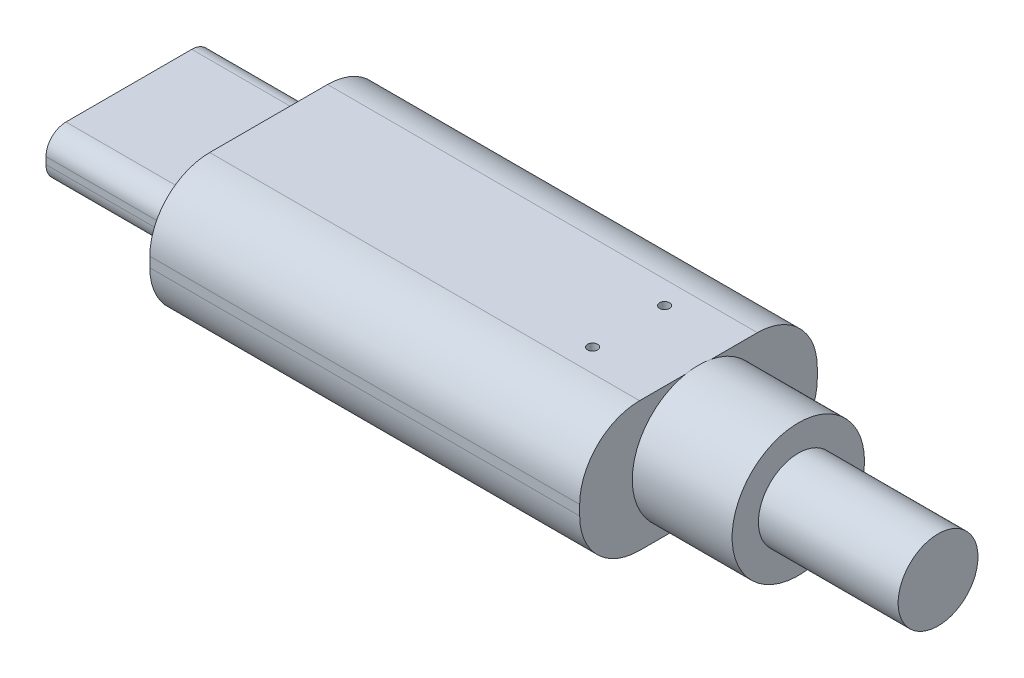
ISO-10303-21;
HEADER;
FILE_DESCRIPTION(('STEP AP214'),'2;1');
FILE_NAME('part.step','',(''),(''),'','','');
FILE_SCHEMA(('AUTOMOTIVE_DESIGN { 1 0 10303 214 1 1 1 1 }'));
ENDSEC;
DATA;
#1=APPLICATION_CONTEXT('core data for automotive mechanical design processes');
#2=APPLICATION_PROTOCOL_DEFINITION('international standard','automotive_design',2000,#1);
#3=PRODUCT_CONTEXT('',#1,'mechanical');
#4=PRODUCT('Part','Part','',(#3));
#5=PRODUCT_RELATED_PRODUCT_CATEGORY('part','',(#4));
#6=PRODUCT_DEFINITION_FORMATION('','',#4);
#7=PRODUCT_DEFINITION_CONTEXT('part definition',#1,'design');
#8=PRODUCT_DEFINITION('design','',#6,#7);
#9=PRODUCT_DEFINITION_SHAPE('','',#8);
#10=(LENGTH_UNIT() NAMED_UNIT(*) SI_UNIT(.MILLI.,.METRE.));
#11=(NAMED_UNIT(*) PLANE_ANGLE_UNIT() SI_UNIT($,.RADIAN.));
#12=(NAMED_UNIT(*) SI_UNIT($,.STERADIAN.) SOLID_ANGLE_UNIT());
#13=UNCERTAINTY_MEASURE_WITH_UNIT(LENGTH_MEASURE(1.E-05),#10,'distance_accuracy_value','');
#14=(GEOMETRIC_REPRESENTATION_CONTEXT(3) GLOBAL_UNCERTAINTY_ASSIGNED_CONTEXT((#13)) GLOBAL_UNIT_ASSIGNED_CONTEXT((#10,
#11,#12)) REPRESENTATION_CONTEXT('',''));
#15=CARTESIAN_POINT('',(0.,0.,0.));
#16=DIRECTION('',(0.,0.,1.));
#17=DIRECTION('',(1.,0.,0.));
#18=AXIS2_PLACEMENT_3D('',#15,#16,#17);
#19=CARTESIAN_POINT('',(-10.765,0.,5.95));
#20=DIRECTION('',(0.,0.,1.));
#21=DIRECTION('',(1.,0.,0.));
#22=AXIS2_PLACEMENT_3D('',#19,#20,#21);
#23=PLANE('',#22);
#24=DIRECTION('',(-1.,0.,0.));
#25=VECTOR('',#24,1.);
#26=CARTESIAN_POINT('',(-5.3825,3.,5.95));
#27=LINE('',#26,#25);
#28=CARTESIAN_POINT('',(10.765,3.,5.95));
#29=VERTEX_POINT('',#28);
#30=CARTESIAN_POINT('',(-10.765,3.,5.95));
#31=VERTEX_POINT('',#30);
#32=EDGE_CURVE('E207',#29,#31,#27,.T.);
#33=ORIENTED_EDGE('',*,*,#32,.F.);
#34=DIRECTION('',(0.,1.,0.));
#35=VECTOR('',#34,1.);
#36=CARTESIAN_POINT('',(10.765,0.,5.95));
#37=LINE('',#36,#35);
#38=CARTESIAN_POINT('',(10.765,3.5,5.95));
#39=VERTEX_POINT('',#38);
#40=EDGE_CURVE('E11',#29,#39,#37,.T.);
#41=ORIENTED_EDGE('',*,*,#40,.T.);
#42=DIRECTION('',(1.,0.,0.));
#43=VECTOR('',#42,1.);
#44=CARTESIAN_POINT('',(-5.3825,3.5,5.95));
#45=LINE('',#44,#43);
#46=CARTESIAN_POINT('',(-10.765,3.5,5.95));
#47=VERTEX_POINT('',#46);
#48=EDGE_CURVE('E466',#47,#39,#45,.T.);
#49=ORIENTED_EDGE('',*,*,#48,.F.);
#50=DIRECTION('',(0.,1.,0.));
#51=VECTOR('',#50,1.);
#52=CARTESIAN_POINT('',(-10.765,0.,5.95));
#53=LINE('',#52,#51);
#54=EDGE_CURVE('E218',#31,#47,#53,.T.);
#55=ORIENTED_EDGE('',*,*,#54,.F.);
#56=EDGE_LOOP('',(#33,#41,#49,#55));
#57=FACE_BOUND('',#56,.T.);
#58=ADVANCED_FACE('F17',(#57),#23,.T.);
#59=CARTESIAN_POINT('',(10.765,0.,-5.95));
#60=DIRECTION('',(0.,0.,-1.));
#61=DIRECTION('',(0.,-1.,0.));
#62=AXIS2_PLACEMENT_3D('',#59,#60,#61);
#63=PLANE('',#62);
#64=DIRECTION('',(1.,0.,0.));
#65=VECTOR('',#64,1.);
#66=CARTESIAN_POINT('',(5.3825,3.,-5.95));
#67=LINE('',#66,#65);
#68=CARTESIAN_POINT('',(-10.765,3.,-5.95));
#69=VERTEX_POINT('',#68);
#70=CARTESIAN_POINT('',(10.765,3.,-5.95));
#71=VERTEX_POINT('',#70);
#72=EDGE_CURVE('E224',#69,#71,#67,.T.);
#73=ORIENTED_EDGE('',*,*,#72,.F.);
#74=DIRECTION('',(0.,1.,0.));
#75=VECTOR('',#74,1.);
#76=CARTESIAN_POINT('',(-10.765,0.,-5.95));
#77=LINE('',#76,#75);
#78=CARTESIAN_POINT('',(-10.765,3.5,-5.95));
#79=VERTEX_POINT('',#78);
#80=EDGE_CURVE('E212',#69,#79,#77,.T.);
#81=ORIENTED_EDGE('',*,*,#80,.T.);
#82=DIRECTION('',(-1.,0.,0.));
#83=VECTOR('',#82,1.);
#84=CARTESIAN_POINT('',(5.3825,3.5,-5.95));
#85=LINE('',#84,#83);
#86=CARTESIAN_POINT('',(10.765,3.5,-5.95));
#87=VERTEX_POINT('',#86);
#88=EDGE_CURVE('E326',#87,#79,#85,.T.);
#89=ORIENTED_EDGE('',*,*,#88,.F.);
#90=DIRECTION('',(0.,1.,0.));
#91=VECTOR('',#90,1.);
#92=CARTESIAN_POINT('',(10.765,0.,-5.95));
#93=LINE('',#92,#91);
#94=EDGE_CURVE('E219',#71,#87,#93,.T.);
#95=ORIENTED_EDGE('',*,*,#94,.F.);
#96=EDGE_LOOP('',(#73,#81,#89,#95));
#97=FACE_BOUND('',#96,.T.);
#98=ADVANCED_FACE('F382',(#97),#63,.T.);
#99=CARTESIAN_POINT('',(10.765,0.,5.95));
#100=DIRECTION('',(1.,0.,0.));
#101=DIRECTION('',(0.,0.,-1.));
#102=AXIS2_PLACEMENT_3D('',#99,#100,#101);
#103=PLANE('',#102);
#104=CARTESIAN_POINT('',(10.765,3.,2.95));
#105=DIRECTION('',(-1.,0.,0.));
#106=DIRECTION('',(0.,-0.707106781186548,0.707106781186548));
#107=AXIS2_PLACEMENT_3D('',#104,#105,#106);
#108=CIRCLE('',#107,3.);
#109=CARTESIAN_POINT('',(10.765,0.,2.95));
#110=VERTEX_POINT('',#109);
#111=EDGE_CURVE('E203',#110,#29,#108,.T.);
#112=ORIENTED_EDGE('',*,*,#111,.F.);
#113=DIRECTION('',(0.,0.,1.));
#114=VECTOR('',#113,1.);
#115=CARTESIAN_POINT('',(10.765,0.,-5.95));
#116=LINE('',#115,#114);
#117=CARTESIAN_POINT('',(10.765,0.,0.653241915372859));
#118=VERTEX_POINT('',#117);
#119=EDGE_CURVE('E317',#118,#110,#116,.T.);
#120=ORIENTED_EDGE('',*,*,#119,.F.);
#121=CARTESIAN_POINT('',(10.765,3.25,0.));
#122=DIRECTION('',(-1.,0.,0.));
#123=DIRECTION('',(0.,0.,1.));
#124=AXIS2_PLACEMENT_3D('',#121,#122,#123);
#125=CIRCLE('',#124,3.315);
#126=CARTESIAN_POINT('',(10.765,6.5,0.653241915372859));
#127=VERTEX_POINT('',#126);
#128=EDGE_CURVE('E28',#118,#127,#125,.T.);
#129=ORIENTED_EDGE('',*,*,#128,.T.);
#130=DIRECTION('',(0.,0.,-1.));
#131=VECTOR('',#130,1.);
#132=CARTESIAN_POINT('',(10.765,6.5,-5.95));
#133=LINE('',#132,#131);
#134=CARTESIAN_POINT('',(10.765,6.5,2.95));
#135=VERTEX_POINT('',#134);
#136=EDGE_CURVE('E416',#135,#127,#133,.T.);
#137=ORIENTED_EDGE('',*,*,#136,.F.);
#138=CARTESIAN_POINT('',(10.765,3.5,2.95));
#139=DIRECTION('',(-1.,0.,0.));
#140=DIRECTION('',(0.,0.707106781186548,0.707106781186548));
#141=AXIS2_PLACEMENT_3D('',#138,#139,#140);
#142=CIRCLE('',#141,3.);
#143=EDGE_CURVE('E418',#39,#135,#142,.T.);
#144=ORIENTED_EDGE('',*,*,#143,.F.);
#145=ORIENTED_EDGE('',*,*,#40,.F.);
#146=EDGE_LOOP('',(#112,#120,#129,#137,#144,#145));
#147=FACE_BOUND('',#146,.T.);
#148=ADVANCED_FACE('F463',(#147),#103,.T.);
#149=CARTESIAN_POINT('',(15.765,3.25,0.));
#150=DIRECTION('',(1.,0.,0.));
#151=DIRECTION('',(0.,0.,-1.));
#152=AXIS2_PLACEMENT_3D('',#149,#150,#151);
#153=PLANE('',#152);
#154=CARTESIAN_POINT('',(15.765,3.25,0.));
#155=DIRECTION('',(-1.,0.,0.));
#156=DIRECTION('',(0.,0.,1.));
#157=AXIS2_PLACEMENT_3D('',#154,#155,#156);
#158=CIRCLE('',#157,2.);
#159=CARTESIAN_POINT('',(15.765,3.25,-2.));
#160=VERTEX_POINT('',#159);
#161=EDGE_CURVE('E338',#160,#160,#158,.T.);
#162=ORIENTED_EDGE('',*,*,#161,.T.);
#163=EDGE_LOOP('',(#162));
#164=FACE_BOUND('',#163,.T.);
#165=CARTESIAN_POINT('',(15.765,3.25,0.));
#166=DIRECTION('',(1.,0.,0.));
#167=DIRECTION('',(0.,0.,1.));
#168=AXIS2_PLACEMENT_3D('',#165,#166,#167);
#169=CIRCLE('',#168,3.315);
#170=CARTESIAN_POINT('',(15.765,3.25,-3.315));
#171=VERTEX_POINT('',#170);
#172=EDGE_CURVE('E277',#171,#171,#169,.T.);
#173=ORIENTED_EDGE('',*,*,#172,.T.);
#174=EDGE_LOOP('',(#173));
#175=FACE_BOUND('',#174,.T.);
#176=ADVANCED_FACE('F549',(#164,#175),#153,.T.);
#177=CARTESIAN_POINT('',(10.765,3.25,0.));
#178=DIRECTION('',(1.,0.,0.));
#179=DIRECTION('',(0.,0.,1.));
#180=AXIS2_PLACEMENT_3D('',#177,#178,#179);
#181=CYLINDRICAL_SURFACE('',#180,3.315);
#182=ORIENTED_EDGE('',*,*,#172,.F.);
#183=DIRECTION('',(-1.,0.,0.));
#184=VECTOR('',#183,1.);
#185=CARTESIAN_POINT('',(10.765,3.25,-3.315));
#186=LINE('',#185,#184);
#187=CARTESIAN_POINT('',(10.765,3.25,-3.315));
#188=VERTEX_POINT('',#187);
#189=EDGE_CURVE('E42',#171,#188,#186,.T.);
#190=ORIENTED_EDGE('',*,*,#189,.T.);
#191=CARTESIAN_POINT('',(10.765,3.25,0.));
#192=DIRECTION('',(-1.,0.,0.));
#193=DIRECTION('',(0.,0.,1.));
#194=AXIS2_PLACEMENT_3D('',#191,#192,#193);
#195=CIRCLE('',#194,3.315);
#196=CARTESIAN_POINT('',(10.765,6.5,-0.653241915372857));
#197=VERTEX_POINT('',#196);
#198=EDGE_CURVE('E321',#197,#188,#195,.T.);
#199=ORIENTED_EDGE('',*,*,#198,.F.);
#200=CARTESIAN_POINT('',(10.765,3.25,0.));
#201=DIRECTION('',(-1.,0.,0.));
#202=DIRECTION('',(0.,0.,1.));
#203=AXIS2_PLACEMENT_3D('',#200,#201,#202);
#204=CIRCLE('',#203,3.315);
#205=EDGE_CURVE('E278',#127,#197,#204,.T.);
#206=ORIENTED_EDGE('',*,*,#205,.F.);
#207=ORIENTED_EDGE('',*,*,#128,.F.);
#208=CARTESIAN_POINT('',(10.765,3.25,0.));
#209=DIRECTION('',(-1.,0.,0.));
#210=DIRECTION('',(0.,0.,1.));
#211=AXIS2_PLACEMENT_3D('',#208,#209,#210);
#212=CIRCLE('',#211,3.315);
#213=CARTESIAN_POINT('',(10.765,0.,-0.653241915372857));
#214=VERTEX_POINT('',#213);
#215=EDGE_CURVE('E273',#214,#118,#212,.T.);
#216=ORIENTED_EDGE('',*,*,#215,.F.);
#217=CARTESIAN_POINT('',(10.765,3.25,0.));
#218=DIRECTION('',(-1.,0.,0.));
#219=DIRECTION('',(0.,0.,1.));
#220=AXIS2_PLACEMENT_3D('',#217,#218,#219);
#221=CIRCLE('',#220,3.315);
#222=EDGE_CURVE('E325',#188,#214,#221,.T.);
#223=ORIENTED_EDGE('',*,*,#222,.F.);
#224=ORIENTED_EDGE('',*,*,#189,.F.);
#225=EDGE_LOOP('',(#182,#190,#199,#206,#207,#216,#223,#224));
#226=FACE_BOUND('',#225,.T.);
#227=ADVANCED_FACE('F408',(#226),#181,.T.);
#228=CARTESIAN_POINT('',(10.765,3.25,0.));
#229=DIRECTION('',(1.,0.,0.));
#230=DIRECTION('',(0.,0.,-1.));
#231=AXIS2_PLACEMENT_3D('',#228,#229,#230);
#232=PLANE('',#231);
#233=DIRECTION('',(0.,0.,1.));
#234=VECTOR('',#233,1.);
#235=CARTESIAN_POINT('',(10.765,0.,-5.95));
#236=LINE('',#235,#234);
#237=EDGE_CURVE('E250',#214,#118,#236,.T.);
#238=ORIENTED_EDGE('',*,*,#237,.F.);
#239=ORIENTED_EDGE('',*,*,#215,.T.);
#240=EDGE_LOOP('',(#238,#239));
#241=FACE_BOUND('',#240,.T.);
#242=ADVANCED_FACE('F548',(#241),#232,.F.);
#243=CARTESIAN_POINT('',(10.765,3.25,0.));
#244=DIRECTION('',(1.,0.,0.));
#245=DIRECTION('',(0.,0.,-1.));
#246=AXIS2_PLACEMENT_3D('',#243,#244,#245);
#247=PLANE('',#246);
#248=DIRECTION('',(0.,0.,-1.));
#249=VECTOR('',#248,1.);
#250=CARTESIAN_POINT('',(10.765,6.5,-5.95));
#251=LINE('',#250,#249);
#252=EDGE_CURVE('E245',#127,#197,#251,.T.);
#253=ORIENTED_EDGE('',*,*,#252,.F.);
#254=ORIENTED_EDGE('',*,*,#205,.T.);
#255=EDGE_LOOP('',(#253,#254));
#256=FACE_BOUND('',#255,.T.);
#257=ADVANCED_FACE('F553',(#256),#247,.F.);
#258=CARTESIAN_POINT('',(-10.765,2.075,4.15));
#259=DIRECTION('',(0.,0.,1.));
#260=DIRECTION('',(1.,0.,0.));
#261=AXIS2_PLACEMENT_3D('',#258,#259,#260);
#262=PLANE('',#261);
#263=DIRECTION('',(-1.,0.,0.));
#264=VECTOR('',#263,1.);
#265=CARTESIAN_POINT('',(-10.765,3.075,4.15));
#266=LINE('',#265,#264);
#267=CARTESIAN_POINT('',(-10.765,3.075,4.15));
#268=VERTEX_POINT('',#267);
#269=CARTESIAN_POINT('',(-17.765,3.075,4.15));
#270=VERTEX_POINT('',#269);
#271=EDGE_CURVE('E197',#268,#270,#266,.T.);
#272=ORIENTED_EDGE('',*,*,#271,.F.);
#273=DIRECTION('',(0.,-1.,0.));
#274=VECTOR('',#273,1.);
#275=CARTESIAN_POINT('',(-10.765,1.0375,4.15));
#276=LINE('',#275,#274);
#277=CARTESIAN_POINT('',(-10.765,3.425,4.15));
#278=VERTEX_POINT('',#277);
#279=EDGE_CURVE('E264',#278,#268,#276,.T.);
#280=ORIENTED_EDGE('',*,*,#279,.F.);
#281=DIRECTION('',(1.,0.,0.));
#282=VECTOR('',#281,1.);
#283=CARTESIAN_POINT('',(-10.765,3.425,4.15));
#284=LINE('',#283,#282);
#285=CARTESIAN_POINT('',(-17.765,3.425,4.15));
#286=VERTEX_POINT('',#285);
#287=EDGE_CURVE('E201',#286,#278,#284,.T.);
#288=ORIENTED_EDGE('',*,*,#287,.F.);
#289=DIRECTION('',(0.,1.,0.));
#290=VECTOR('',#289,1.);
#291=CARTESIAN_POINT('',(-17.765,2.075,4.15));
#292=LINE('',#291,#290);
#293=EDGE_CURVE('E344',#270,#286,#292,.T.);
#294=ORIENTED_EDGE('',*,*,#293,.F.);
#295=EDGE_LOOP('',(#272,#280,#288,#294));
#296=FACE_BOUND('',#295,.T.);
#297=ADVANCED_FACE('F556',(#296),#262,.T.);
#298=CARTESIAN_POINT('',(-10.765,4.425,-4.15));
#299=DIRECTION('',(0.,0.,-1.));
#300=DIRECTION('',(0.,-1.,0.));
#301=AXIS2_PLACEMENT_3D('',#298,#299,#300);
#302=PLANE('',#301);
#303=DIRECTION('',(-1.,0.,0.));
#304=VECTOR('',#303,1.);
#305=CARTESIAN_POINT('',(-10.765,3.425,-4.15));
#306=LINE('',#305,#304);
#307=CARTESIAN_POINT('',(-10.765,3.425,-4.15));
#308=VERTEX_POINT('',#307);
#309=CARTESIAN_POINT('',(-17.765,3.425,-4.15));
#310=VERTEX_POINT('',#309);
#311=EDGE_CURVE('E282',#308,#310,#306,.T.);
#312=ORIENTED_EDGE('',*,*,#311,.F.);
#313=DIRECTION('',(0.,1.,0.));
#314=VECTOR('',#313,1.);
#315=CARTESIAN_POINT('',(-10.765,2.2125,-4.15));
#316=LINE('',#315,#314);
#317=CARTESIAN_POINT('',(-10.765,3.075,-4.15));
#318=VERTEX_POINT('',#317);
#319=EDGE_CURVE('E233',#318,#308,#316,.T.);
#320=ORIENTED_EDGE('',*,*,#319,.F.);
#321=DIRECTION('',(1.,0.,0.));
#322=VECTOR('',#321,1.);
#323=CARTESIAN_POINT('',(-10.765,3.075,-4.15));
#324=LINE('',#323,#322);
#325=CARTESIAN_POINT('',(-17.765,3.075,-4.15));
#326=VERTEX_POINT('',#325);
#327=EDGE_CURVE('E256',#326,#318,#324,.T.);
#328=ORIENTED_EDGE('',*,*,#327,.F.);
#329=DIRECTION('',(0.,-1.,0.));
#330=VECTOR('',#329,1.);
#331=CARTESIAN_POINT('',(-17.765,4.425,-4.15));
#332=LINE('',#331,#330);
#333=EDGE_CURVE('E292',#310,#326,#332,.T.);
#334=ORIENTED_EDGE('',*,*,#333,.F.);
#335=EDGE_LOOP('',(#312,#320,#328,#334));
#336=FACE_BOUND('',#335,.T.);
#337=ADVANCED_FACE('F558',(#336),#302,.T.);
#338=CARTESIAN_POINT('',(5.3825,3.5,-2.95));
#339=DIRECTION('',(-1.,0.,0.));
#340=DIRECTION('',(0.,0.707106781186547,-0.707106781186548));
#341=AXIS2_PLACEMENT_3D('',#338,#339,#340);
#342=CYLINDRICAL_SURFACE('',#341,3.);
#343=CARTESIAN_POINT('',(-10.765,3.5,-2.95));
#344=DIRECTION('',(1.,0.,0.));
#345=DIRECTION('',(0.,0.707106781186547,-0.707106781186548));
#346=AXIS2_PLACEMENT_3D('',#343,#344,#345);
#347=CIRCLE('',#346,3.);
#348=CARTESIAN_POINT('',(-10.765,6.5,-2.95));
#349=VERTEX_POINT('',#348);
#350=EDGE_CURVE('E208',#79,#349,#347,.T.);
#351=ORIENTED_EDGE('',*,*,#350,.T.);
#352=DIRECTION('',(1.,0.,0.));
#353=VECTOR('',#352,1.);
#354=CARTESIAN_POINT('',(5.3825,6.5,-2.95));
#355=LINE('',#354,#353);
#356=CARTESIAN_POINT('',(10.765,6.5,-2.95));
#357=VERTEX_POINT('',#356);
#358=EDGE_CURVE('E244',#349,#357,#355,.T.);
#359=ORIENTED_EDGE('',*,*,#358,.T.);
#360=CARTESIAN_POINT('',(10.765,3.5,-2.95));
#361=DIRECTION('',(-1.,0.,0.));
#362=DIRECTION('',(0.,0.707106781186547,-0.707106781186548));
#363=AXIS2_PLACEMENT_3D('',#360,#361,#362);
#364=CIRCLE('',#363,3.);
#365=EDGE_CURVE('E223',#357,#87,#364,.T.);
#366=ORIENTED_EDGE('',*,*,#365,.T.);
#367=ORIENTED_EDGE('',*,*,#88,.T.);
#368=EDGE_LOOP('',(#351,#359,#366,#367));
#369=FACE_BOUND('',#368,.T.);
#370=ADVANCED_FACE('F374',(#369),#342,.T.);
#371=CARTESIAN_POINT('',(10.765,0.,5.95));
#372=DIRECTION('',(1.,0.,0.));
#373=DIRECTION('',(0.,0.,-1.));
#374=AXIS2_PLACEMENT_3D('',#371,#372,#373);
#375=PLANE('',#374);
#376=CARTESIAN_POINT('',(10.765,3.,-2.95));
#377=DIRECTION('',(-1.,0.,0.));
#378=DIRECTION('',(0.,-0.707106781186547,-0.707106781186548));
#379=AXIS2_PLACEMENT_3D('',#376,#377,#378);
#380=CIRCLE('',#379,3.);
#381=CARTESIAN_POINT('',(10.765,0.,-2.95));
#382=VERTEX_POINT('',#381);
#383=EDGE_CURVE('E228',#71,#382,#380,.T.);
#384=ORIENTED_EDGE('',*,*,#383,.F.);
#385=ORIENTED_EDGE('',*,*,#94,.T.);
#386=ORIENTED_EDGE('',*,*,#365,.F.);
#387=DIRECTION('',(0.,0.,-1.));
#388=VECTOR('',#387,1.);
#389=CARTESIAN_POINT('',(10.765,6.5,-5.95));
#390=LINE('',#389,#388);
#391=EDGE_CURVE('E240',#197,#357,#390,.T.);
#392=ORIENTED_EDGE('',*,*,#391,.F.);
#393=ORIENTED_EDGE('',*,*,#198,.T.);
#394=ORIENTED_EDGE('',*,*,#222,.T.);
#395=DIRECTION('',(0.,0.,1.));
#396=VECTOR('',#395,1.);
#397=CARTESIAN_POINT('',(10.765,0.,-5.95));
#398=LINE('',#397,#396);
#399=EDGE_CURVE('E246',#382,#214,#398,.T.);
#400=ORIENTED_EDGE('',*,*,#399,.F.);
#401=EDGE_LOOP('',(#384,#385,#386,#392,#393,#394,#400));
#402=FACE_BOUND('',#401,.T.);
#403=ADVANCED_FACE('F378',(#402),#375,.T.);
#404=CARTESIAN_POINT('',(5.3825,3.,-2.95));
#405=DIRECTION('',(1.,0.,0.));
#406=DIRECTION('',(0.,-0.707106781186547,-0.707106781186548));
#407=AXIS2_PLACEMENT_3D('',#404,#405,#406);
#408=CYLINDRICAL_SURFACE('',#407,3.);
#409=ORIENTED_EDGE('',*,*,#383,.T.);
#410=DIRECTION('',(-1.,0.,0.));
#411=VECTOR('',#410,1.);
#412=CARTESIAN_POINT('',(5.3825,0.,-2.95));
#413=LINE('',#412,#411);
#414=CARTESIAN_POINT('',(-10.765,0.,-2.95));
#415=VERTEX_POINT('',#414);
#416=EDGE_CURVE('E251',#382,#415,#413,.T.);
#417=ORIENTED_EDGE('',*,*,#416,.T.);
#418=CARTESIAN_POINT('',(-10.765,3.,-2.95));
#419=DIRECTION('',(1.,0.,0.));
#420=DIRECTION('',(0.,-0.707106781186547,-0.707106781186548));
#421=AXIS2_PLACEMENT_3D('',#418,#419,#420);
#422=CIRCLE('',#421,3.);
#423=EDGE_CURVE('E229',#415,#69,#422,.T.);
#424=ORIENTED_EDGE('',*,*,#423,.T.);
#425=ORIENTED_EDGE('',*,*,#72,.T.);
#426=EDGE_LOOP('',(#409,#417,#424,#425));
#427=FACE_BOUND('',#426,.T.);
#428=ADVANCED_FACE('F384',(#427),#408,.T.);
#429=CARTESIAN_POINT('',(0.,6.5,0.));
#430=DIRECTION('',(0.,1.,0.));
#431=DIRECTION('',(1.,0.,0.));
#432=AXIS2_PLACEMENT_3D('',#429,#430,#431);
#433=PLANE('',#432);
#434=CARTESIAN_POINT('',(7.265,6.5,-1.80162095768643));
#435=DIRECTION('',(0.,-1.,0.));
#436=DIRECTION('',(-1.,0.,0.));
#437=AXIS2_PLACEMENT_3D('',#434,#435,#436);
#438=CIRCLE('',#437,0.25);
#439=CARTESIAN_POINT('',(7.515,6.5,-1.80162095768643));
#440=VERTEX_POINT('',#439);
#441=EDGE_CURVE('E191',#440,#440,#438,.T.);
#442=ORIENTED_EDGE('',*,*,#441,.T.);
#443=EDGE_LOOP('',(#442));
#444=FACE_BOUND('',#443,.T.);
#445=CARTESIAN_POINT('',(7.265,6.5,1.80162095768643));
#446=DIRECTION('',(0.,-1.,0.));
#447=DIRECTION('',(-1.,0.,0.));
#448=AXIS2_PLACEMENT_3D('',#445,#446,#447);
#449=CIRCLE('',#448,0.25);
#450=CARTESIAN_POINT('',(7.515,6.5,1.80162095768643));
#451=VERTEX_POINT('',#450);
#452=EDGE_CURVE('E239',#451,#451,#449,.T.);
#453=ORIENTED_EDGE('',*,*,#452,.T.);
#454=EDGE_LOOP('',(#453));
#455=FACE_BOUND('',#454,.T.);
#456=DIRECTION('',(-1.,0.,0.));
#457=VECTOR('',#456,1.);
#458=CARTESIAN_POINT('',(-5.3825,6.5,2.95));
#459=LINE('',#458,#457);
#460=CARTESIAN_POINT('',(-10.765,6.5,2.95));
#461=VERTEX_POINT('',#460);
#462=EDGE_CURVE('E21',#135,#461,#459,.T.);
#463=ORIENTED_EDGE('',*,*,#462,.F.);
#464=ORIENTED_EDGE('',*,*,#136,.T.);
#465=ORIENTED_EDGE('',*,*,#252,.T.);
#466=ORIENTED_EDGE('',*,*,#391,.T.);
#467=ORIENTED_EDGE('',*,*,#358,.F.);
#468=DIRECTION('',(0.,0.,1.));
#469=VECTOR('',#468,1.);
#470=CARTESIAN_POINT('',(-10.765,6.5,5.95));
#471=LINE('',#470,#469);
#472=EDGE_CURVE('E213',#349,#461,#471,.T.);
#473=ORIENTED_EDGE('',*,*,#472,.T.);
#474=EDGE_LOOP('',(#463,#464,#465,#466,#467,#473));
#475=FACE_BOUND('',#474,.T.);
#476=ADVANCED_FACE('F399',(#444,#455,#475),#433,.T.);
#477=CARTESIAN_POINT('',(-5.3825,3.5,2.95));
#478=DIRECTION('',(1.,0.,0.));
#479=DIRECTION('',(0.,0.707106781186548,0.707106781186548));
#480=AXIS2_PLACEMENT_3D('',#477,#478,#479);
#481=CYLINDRICAL_SURFACE('',#480,3.);
#482=ORIENTED_EDGE('',*,*,#143,.T.);
#483=ORIENTED_EDGE('',*,*,#462,.T.);
#484=CARTESIAN_POINT('',(-10.765,3.5,2.95));
#485=DIRECTION('',(1.,0.,0.));
#486=DIRECTION('',(0.,0.707106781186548,0.707106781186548));
#487=AXIS2_PLACEMENT_3D('',#484,#485,#486);
#488=CIRCLE('',#487,3.);
#489=EDGE_CURVE('E214',#461,#47,#488,.T.);
#490=ORIENTED_EDGE('',*,*,#489,.T.);
#491=ORIENTED_EDGE('',*,*,#48,.T.);
#492=EDGE_LOOP('',(#482,#483,#490,#491));
#493=FACE_BOUND('',#492,.T.);
#494=ADVANCED_FACE('F511',(#493),#481,.T.);
#495=CARTESIAN_POINT('',(-10.765,0.,-5.95));
#496=DIRECTION('',(-1.,0.,0.));
#497=DIRECTION('',(0.,0.,1.));
#498=AXIS2_PLACEMENT_3D('',#495,#496,#497);
#499=PLANE('',#498);
#500=ORIENTED_EDGE('',*,*,#319,.T.);
#501=CARTESIAN_POINT('',(-10.765,3.425,-3.15));
#502=DIRECTION('',(-1.,0.,0.));
#503=DIRECTION('',(0.,0.707106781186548,-0.707106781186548));
#504=AXIS2_PLACEMENT_3D('',#501,#502,#503);
#505=CIRCLE('',#504,1.);
#506=CARTESIAN_POINT('',(-10.765,4.425,-3.15));
#507=VERTEX_POINT('',#506);
#508=EDGE_CURVE('E271',#507,#308,#505,.T.);
#509=ORIENTED_EDGE('',*,*,#508,.F.);
#510=DIRECTION('',(0.,0.,1.));
#511=VECTOR('',#510,1.);
#512=CARTESIAN_POINT('',(-10.765,4.425,-0.9));
#513=LINE('',#512,#511);
#514=CARTESIAN_POINT('',(-10.765,4.425,3.15));
#515=VERTEX_POINT('',#514);
#516=EDGE_CURVE('E363',#507,#515,#513,.T.);
#517=ORIENTED_EDGE('',*,*,#516,.T.);
#518=CARTESIAN_POINT('',(-10.765,3.425,3.15));
#519=DIRECTION('',(-1.,0.,0.));
#520=DIRECTION('',(0.,0.707106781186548,0.707106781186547));
#521=AXIS2_PLACEMENT_3D('',#518,#519,#520);
#522=CIRCLE('',#521,1.);
#523=EDGE_CURVE('E261',#278,#515,#522,.T.);
#524=ORIENTED_EDGE('',*,*,#523,.F.);
#525=ORIENTED_EDGE('',*,*,#279,.T.);
#526=CARTESIAN_POINT('',(-10.765,3.075,3.15));
#527=DIRECTION('',(-1.,0.,0.));
#528=DIRECTION('',(0.,-0.707106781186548,0.707106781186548));
#529=AXIS2_PLACEMENT_3D('',#526,#527,#528);
#530=CIRCLE('',#529,1.);
#531=CARTESIAN_POINT('',(-10.765,2.075,3.15));
#532=VERTEX_POINT('',#531);
#533=EDGE_CURVE('E202',#532,#268,#530,.T.);
#534=ORIENTED_EDGE('',*,*,#533,.F.);
#535=DIRECTION('',(0.,0.,-1.));
#536=VECTOR('',#535,1.);
#537=CARTESIAN_POINT('',(-10.765,2.075,-5.05));
#538=LINE('',#537,#536);
#539=CARTESIAN_POINT('',(-10.765,2.075,-3.15));
#540=VERTEX_POINT('',#539);
#541=EDGE_CURVE('E307',#532,#540,#538,.T.);
#542=ORIENTED_EDGE('',*,*,#541,.T.);
#543=CARTESIAN_POINT('',(-10.765,3.075,-3.15));
#544=DIRECTION('',(-1.,0.,0.));
#545=DIRECTION('',(0.,-0.707106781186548,-0.707106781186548));
#546=AXIS2_PLACEMENT_3D('',#543,#544,#545);
#547=CIRCLE('',#546,1.);
#548=EDGE_CURVE('E252',#318,#540,#547,.T.);
#549=ORIENTED_EDGE('',*,*,#548,.F.);
#550=EDGE_LOOP('',(#500,#509,#517,#524,#525,#534,#542,#549));
#551=FACE_BOUND('',#550,.T.);
#552=CARTESIAN_POINT('',(-10.765,3.,2.95));
#553=DIRECTION('',(1.,0.,0.));
#554=DIRECTION('',(0.,-0.707106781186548,0.707106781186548));
#555=AXIS2_PLACEMENT_3D('',#552,#553,#554);
#556=CIRCLE('',#555,3.);
#557=CARTESIAN_POINT('',(-10.765,0.,2.95));
#558=VERTEX_POINT('',#557);
#559=EDGE_CURVE('E181',#31,#558,#556,.T.);
#560=ORIENTED_EDGE('',*,*,#559,.F.);
#561=ORIENTED_EDGE('',*,*,#54,.T.);
#562=ORIENTED_EDGE('',*,*,#489,.F.);
#563=ORIENTED_EDGE('',*,*,#472,.F.);
#564=ORIENTED_EDGE('',*,*,#350,.F.);
#565=ORIENTED_EDGE('',*,*,#80,.F.);
#566=ORIENTED_EDGE('',*,*,#423,.F.);
#567=DIRECTION('',(0.,0.,-1.));
#568=VECTOR('',#567,1.);
#569=CARTESIAN_POINT('',(-10.765,0.,5.95));
#570=LINE('',#569,#568);
#571=EDGE_CURVE('E331',#558,#415,#570,.T.);
#572=ORIENTED_EDGE('',*,*,#571,.F.);
#573=EDGE_LOOP('',(#560,#561,#562,#563,#564,#565,#566,#572));
#574=FACE_BOUND('',#573,.T.);
#575=ADVANCED_FACE('F393',(#551,#574),#499,.T.);
#576=CARTESIAN_POINT('',(0.,0.,0.));
#577=DIRECTION('',(0.,-1.,0.));
#578=DIRECTION('',(0.,0.,-1.));
#579=AXIS2_PLACEMENT_3D('',#576,#577,#578);
#580=PLANE('',#579);
#581=CARTESIAN_POINT('',(7.265,0.,-1.80162095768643));
#582=DIRECTION('',(0.,1.,0.));
#583=DIRECTION('',(-1.,0.,0.));
#584=AXIS2_PLACEMENT_3D('',#581,#582,#583);
#585=CIRCLE('',#584,0.25);
#586=CARTESIAN_POINT('',(7.515,0.,-1.80162095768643));
#587=VERTEX_POINT('',#586);
#588=EDGE_CURVE('E175',#587,#587,#585,.T.);
#589=ORIENTED_EDGE('',*,*,#588,.T.);
#590=EDGE_LOOP('',(#589));
#591=FACE_BOUND('',#590,.T.);
#592=CARTESIAN_POINT('',(7.265,0.,1.80162095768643));
#593=DIRECTION('',(0.,1.,0.));
#594=DIRECTION('',(-1.,0.,0.));
#595=AXIS2_PLACEMENT_3D('',#592,#593,#594);
#596=CIRCLE('',#595,0.25);
#597=CARTESIAN_POINT('',(7.515,0.,1.80162095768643));
#598=VERTEX_POINT('',#597);
#599=EDGE_CURVE('E238',#598,#598,#596,.T.);
#600=ORIENTED_EDGE('',*,*,#599,.T.);
#601=EDGE_LOOP('',(#600));
#602=FACE_BOUND('',#601,.T.);
#603=DIRECTION('',(1.,0.,0.));
#604=VECTOR('',#603,1.);
#605=CARTESIAN_POINT('',(-5.3825,0.,2.95));
#606=LINE('',#605,#604);
#607=EDGE_CURVE('E189',#558,#110,#606,.T.);
#608=ORIENTED_EDGE('',*,*,#607,.F.);
#609=ORIENTED_EDGE('',*,*,#571,.T.);
#610=ORIENTED_EDGE('',*,*,#416,.F.);
#611=ORIENTED_EDGE('',*,*,#399,.T.);
#612=ORIENTED_EDGE('',*,*,#237,.T.);
#613=ORIENTED_EDGE('',*,*,#119,.T.);
#614=EDGE_LOOP('',(#608,#609,#610,#611,#612,#613));
#615=FACE_BOUND('',#614,.T.);
#616=ADVANCED_FACE('F176',(#591,#602,#615),#580,.T.);
#617=CARTESIAN_POINT('',(-5.3825,3.,2.95));
#618=DIRECTION('',(-1.,0.,0.));
#619=DIRECTION('',(0.,-0.707106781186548,0.707106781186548));
#620=AXIS2_PLACEMENT_3D('',#617,#618,#619);
#621=CYLINDRICAL_SURFACE('',#620,3.);
#622=ORIENTED_EDGE('',*,*,#559,.T.);
#623=ORIENTED_EDGE('',*,*,#607,.T.);
#624=ORIENTED_EDGE('',*,*,#111,.T.);
#625=ORIENTED_EDGE('',*,*,#32,.T.);
#626=EDGE_LOOP('',(#622,#623,#624,#625));
#627=FACE_BOUND('',#626,.T.);
#628=ADVANCED_FACE('F564',(#627),#621,.T.);
#629=CARTESIAN_POINT('',(7.265,6.5,-1.80162095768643));
#630=DIRECTION('',(0.,-1.,0.));
#631=DIRECTION('',(-1.,0.,0.));
#632=AXIS2_PLACEMENT_3D('',#629,#630,#631);
#633=CYLINDRICAL_SURFACE('',#632,0.25);
#634=ORIENTED_EDGE('',*,*,#441,.F.);
#635=DIRECTION('',(0.,-1.,0.));
#636=VECTOR('',#635,1.);
#637=CARTESIAN_POINT('',(7.515,6.5,-1.80162095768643));
#638=LINE('',#637,#636);
#639=EDGE_CURVE('E182',#440,#587,#638,.T.);
#640=ORIENTED_EDGE('',*,*,#639,.T.);
#641=ORIENTED_EDGE('',*,*,#588,.F.);
#642=ORIENTED_EDGE('',*,*,#639,.F.);
#643=EDGE_LOOP('',(#634,#640,#641,#642));
#644=FACE_BOUND('',#643,.T.);
#645=ADVANCED_FACE('F19',(#644),#633,.F.);
#646=CARTESIAN_POINT('',(7.265,6.5,1.80162095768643));
#647=DIRECTION('',(0.,-1.,0.));
#648=DIRECTION('',(-1.,0.,0.));
#649=AXIS2_PLACEMENT_3D('',#646,#647,#648);
#650=CYLINDRICAL_SURFACE('',#649,0.25);
#651=ORIENTED_EDGE('',*,*,#452,.F.);
#652=DIRECTION('',(0.,-1.,0.));
#653=VECTOR('',#652,1.);
#654=CARTESIAN_POINT('',(7.515,6.5,1.80162095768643));
#655=LINE('',#654,#653);
#656=EDGE_CURVE('E234',#451,#598,#655,.T.);
#657=ORIENTED_EDGE('',*,*,#656,.T.);
#658=ORIENTED_EDGE('',*,*,#599,.F.);
#659=ORIENTED_EDGE('',*,*,#656,.F.);
#660=EDGE_LOOP('',(#651,#657,#658,#659));
#661=FACE_BOUND('',#660,.T.);
#662=ADVANCED_FACE('F508',(#661),#650,.F.);
#663=CARTESIAN_POINT('',(-10.765,3.425,3.15));
#664=DIRECTION('',(-1.,0.,0.));
#665=DIRECTION('',(0.,0.707106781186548,0.707106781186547));
#666=AXIS2_PLACEMENT_3D('',#663,#664,#665);
#667=CYLINDRICAL_SURFACE('',#666,1.);
#668=CARTESIAN_POINT('',(-17.765,3.425,3.15));
#669=DIRECTION('',(1.,0.,0.));
#670=DIRECTION('',(0.,0.707106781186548,0.707106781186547));
#671=AXIS2_PLACEMENT_3D('',#668,#669,#670);
#672=CIRCLE('',#671,1.);
#673=CARTESIAN_POINT('',(-17.765,4.425,3.15));
#674=VERTEX_POINT('',#673);
#675=EDGE_CURVE('E195',#674,#286,#672,.T.);
#676=ORIENTED_EDGE('',*,*,#675,.T.);
#677=ORIENTED_EDGE('',*,*,#287,.T.);
#678=ORIENTED_EDGE('',*,*,#523,.T.);
#679=DIRECTION('',(-1.,0.,0.));
#680=VECTOR('',#679,1.);
#681=CARTESIAN_POINT('',(-10.765,4.425,3.15));
#682=LINE('',#681,#680);
#683=EDGE_CURVE('E367',#515,#674,#682,.T.);
#684=ORIENTED_EDGE('',*,*,#683,.T.);
#685=EDGE_LOOP('',(#676,#677,#678,#684));
#686=FACE_BOUND('',#685,.T.);
#687=ADVANCED_FACE('F589',(#686),#667,.T.);
#688=CARTESIAN_POINT('',(-10.765,3.075,3.15));
#689=DIRECTION('',(-1.,0.,0.));
#690=DIRECTION('',(0.,-0.707106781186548,0.707106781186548));
#691=AXIS2_PLACEMENT_3D('',#688,#689,#690);
#692=CYLINDRICAL_SURFACE('',#691,1.);
#693=CARTESIAN_POINT('',(-17.765,3.075,3.15));
#694=DIRECTION('',(1.,0.,0.));
#695=DIRECTION('',(0.,-0.707106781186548,0.707106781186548));
#696=AXIS2_PLACEMENT_3D('',#693,#694,#695);
#697=CIRCLE('',#696,1.);
#698=CARTESIAN_POINT('',(-17.765,2.075,3.15));
#699=VERTEX_POINT('',#698);
#700=EDGE_CURVE('E306',#270,#699,#697,.T.);
#701=ORIENTED_EDGE('',*,*,#700,.T.);
#702=DIRECTION('',(1.,0.,0.));
#703=VECTOR('',#702,1.);
#704=CARTESIAN_POINT('',(-10.765,2.075,3.15));
#705=LINE('',#704,#703);
#706=EDGE_CURVE('E310',#699,#532,#705,.T.);
#707=ORIENTED_EDGE('',*,*,#706,.T.);
#708=ORIENTED_EDGE('',*,*,#533,.T.);
#709=ORIENTED_EDGE('',*,*,#271,.T.);
#710=EDGE_LOOP('',(#701,#707,#708,#709));
#711=FACE_BOUND('',#710,.T.);
#712=ADVANCED_FACE('F596',(#711),#692,.T.);
#713=CARTESIAN_POINT('',(-10.765,2.075,-4.15));
#714=DIRECTION('',(0.,-1.,0.));
#715=DIRECTION('',(0.,0.,-1.));
#716=AXIS2_PLACEMENT_3D('',#713,#714,#715);
#717=PLANE('',#716);
#718=DIRECTION('',(-1.,0.,0.));
#719=VECTOR('',#718,1.);
#720=CARTESIAN_POINT('',(-10.765,2.075,-3.15));
#721=LINE('',#720,#719);
#722=CARTESIAN_POINT('',(-17.765,2.075,-3.15));
#723=VERTEX_POINT('',#722);
#724=EDGE_CURVE('E255',#540,#723,#721,.T.);
#725=ORIENTED_EDGE('',*,*,#724,.F.);
#726=ORIENTED_EDGE('',*,*,#541,.F.);
#727=ORIENTED_EDGE('',*,*,#706,.F.);
#728=DIRECTION('',(0.,0.,1.));
#729=VECTOR('',#728,1.);
#730=CARTESIAN_POINT('',(-17.765,2.075,-4.15));
#731=LINE('',#730,#729);
#732=EDGE_CURVE('E291',#723,#699,#731,.T.);
#733=ORIENTED_EDGE('',*,*,#732,.F.);
#734=EDGE_LOOP('',(#725,#726,#727,#733));
#735=FACE_BOUND('',#734,.T.);
#736=ADVANCED_FACE('F544',(#735),#717,.T.);
#737=CARTESIAN_POINT('',(-10.765,3.075,-3.15));
#738=DIRECTION('',(-1.,0.,0.));
#739=DIRECTION('',(0.,-0.707106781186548,-0.707106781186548));
#740=AXIS2_PLACEMENT_3D('',#737,#738,#739);
#741=CYLINDRICAL_SURFACE('',#740,1.);
#742=CARTESIAN_POINT('',(-17.765,3.075,-3.15));
#743=DIRECTION('',(1.,0.,0.));
#744=DIRECTION('',(0.,-0.707106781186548,-0.707106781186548));
#745=AXIS2_PLACEMENT_3D('',#742,#743,#744);
#746=CIRCLE('',#745,1.);
#747=EDGE_CURVE('E287',#723,#326,#746,.T.);
#748=ORIENTED_EDGE('',*,*,#747,.T.);
#749=ORIENTED_EDGE('',*,*,#327,.T.);
#750=ORIENTED_EDGE('',*,*,#548,.T.);
#751=ORIENTED_EDGE('',*,*,#724,.T.);
#752=EDGE_LOOP('',(#748,#749,#750,#751));
#753=FACE_BOUND('',#752,.T.);
#754=ADVANCED_FACE('F541',(#753),#741,.T.);
#755=CARTESIAN_POINT('',(-17.765,3.25,0.));
#756=DIRECTION('',(-1.,0.,0.));
#757=DIRECTION('',(0.,0.,1.));
#758=AXIS2_PLACEMENT_3D('',#755,#756,#757);
#759=PLANE('',#758);
#760=CARTESIAN_POINT('',(-17.765,3.425,-3.15));
#761=DIRECTION('',(1.,0.,0.));
#762=DIRECTION('',(0.,0.707106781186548,-0.707106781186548));
#763=AXIS2_PLACEMENT_3D('',#760,#761,#762);
#764=CIRCLE('',#763,1.);
#765=CARTESIAN_POINT('',(-17.765,4.425,-3.15));
#766=VERTEX_POINT('',#765);
#767=EDGE_CURVE('E272',#310,#766,#764,.T.);
#768=ORIENTED_EDGE('',*,*,#767,.F.);
#769=ORIENTED_EDGE('',*,*,#333,.T.);
#770=ORIENTED_EDGE('',*,*,#747,.F.);
#771=ORIENTED_EDGE('',*,*,#732,.T.);
#772=ORIENTED_EDGE('',*,*,#700,.F.);
#773=ORIENTED_EDGE('',*,*,#293,.T.);
#774=ORIENTED_EDGE('',*,*,#675,.F.);
#775=DIRECTION('',(0.,0.,-1.));
#776=VECTOR('',#775,1.);
#777=CARTESIAN_POINT('',(-17.765,4.425,4.15));
#778=LINE('',#777,#776);
#779=EDGE_CURVE('E286',#674,#766,#778,.T.);
#780=ORIENTED_EDGE('',*,*,#779,.T.);
#781=EDGE_LOOP('',(#768,#769,#770,#771,#772,#773,#774,#780));
#782=FACE_BOUND('',#781,.T.);
#783=ADVANCED_FACE('F433',(#782),#759,.T.);
#784=CARTESIAN_POINT('',(-10.765,4.425,4.15));
#785=DIRECTION('',(0.,1.,0.));
#786=DIRECTION('',(0.,0.,-1.));
#787=AXIS2_PLACEMENT_3D('',#784,#785,#786);
#788=PLANE('',#787);
#789=DIRECTION('',(1.,0.,0.));
#790=VECTOR('',#789,1.);
#791=CARTESIAN_POINT('',(-10.765,4.425,-3.15));
#792=LINE('',#791,#790);
#793=EDGE_CURVE('E267',#766,#507,#792,.T.);
#794=ORIENTED_EDGE('',*,*,#793,.F.);
#795=ORIENTED_EDGE('',*,*,#779,.F.);
#796=ORIENTED_EDGE('',*,*,#683,.F.);
#797=ORIENTED_EDGE('',*,*,#516,.F.);
#798=EDGE_LOOP('',(#794,#795,#796,#797));
#799=FACE_BOUND('',#798,.T.);
#800=ADVANCED_FACE('F552',(#799),#788,.T.);
#801=CARTESIAN_POINT('',(-10.765,3.425,-3.15));
#802=DIRECTION('',(-1.,0.,0.));
#803=DIRECTION('',(0.,0.707106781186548,-0.707106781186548));
#804=AXIS2_PLACEMENT_3D('',#801,#802,#803);
#805=CYLINDRICAL_SURFACE('',#804,1.);
#806=ORIENTED_EDGE('',*,*,#767,.T.);
#807=ORIENTED_EDGE('',*,*,#793,.T.);
#808=ORIENTED_EDGE('',*,*,#508,.T.);
#809=ORIENTED_EDGE('',*,*,#311,.T.);
#810=EDGE_LOOP('',(#806,#807,#808,#809));
#811=FACE_BOUND('',#810,.T.);
#812=ADVANCED_FACE('F428',(#811),#805,.T.);
#813=CARTESIAN_POINT('',(22.765,3.25,0.));
#814=DIRECTION('',(1.,0.,0.));
#815=DIRECTION('',(0.,0.,-1.));
#816=AXIS2_PLACEMENT_3D('',#813,#814,#815);
#817=PLANE('',#816);
#818=CARTESIAN_POINT('',(22.765,3.25,0.));
#819=DIRECTION('',(1.,0.,0.));
#820=DIRECTION('',(0.,0.,1.));
#821=AXIS2_PLACEMENT_3D('',#818,#819,#820);
#822=CIRCLE('',#821,2.);
#823=CARTESIAN_POINT('',(22.765,3.25,-2.));
#824=VERTEX_POINT('',#823);
#825=EDGE_CURVE('E298',#824,#824,#822,.T.);
#826=ORIENTED_EDGE('',*,*,#825,.T.);
#827=EDGE_LOOP('',(#826));
#828=FACE_BOUND('',#827,.T.);
#829=ADVANCED_FACE('F536',(#828),#817,.T.);
#830=CARTESIAN_POINT('',(15.765,3.25,0.));
#831=DIRECTION('',(1.,0.,0.));
#832=DIRECTION('',(0.,0.,1.));
#833=AXIS2_PLACEMENT_3D('',#830,#831,#832);
#834=CYLINDRICAL_SURFACE('',#833,2.);
#835=ORIENTED_EDGE('',*,*,#825,.F.);
#836=DIRECTION('',(-1.,0.,0.));
#837=VECTOR('',#836,1.);
#838=CARTESIAN_POINT('',(15.765,3.25,-2.));
#839=LINE('',#838,#837);
#840=EDGE_CURVE('E302',#824,#160,#839,.T.);
#841=ORIENTED_EDGE('',*,*,#840,.T.);
#842=ORIENTED_EDGE('',*,*,#161,.F.);
#843=ORIENTED_EDGE('',*,*,#840,.F.);
#844=EDGE_LOOP('',(#835,#841,#842,#843));
#845=FACE_BOUND('',#844,.T.);
#846=ADVANCED_FACE('F539',(#845),#834,.T.);
#847=CLOSED_SHELL('',(#58,#98,#148,#176,#227,#242,#257,#297,#337,#370,#403,#428,#476,#494,#575,
#616,#628,#645,#662,#687,#712,#736,#754,#783,#800,#812,#829,#846));
#848=MANIFOLD_SOLID_BREP('B1',#847);
#849=ADVANCED_BREP_SHAPE_REPRESENTATION('',(#18,#848),#14);
#850=SHAPE_DEFINITION_REPRESENTATION(#9,#849);
ENDSEC;
END-ISO-10303-21;
